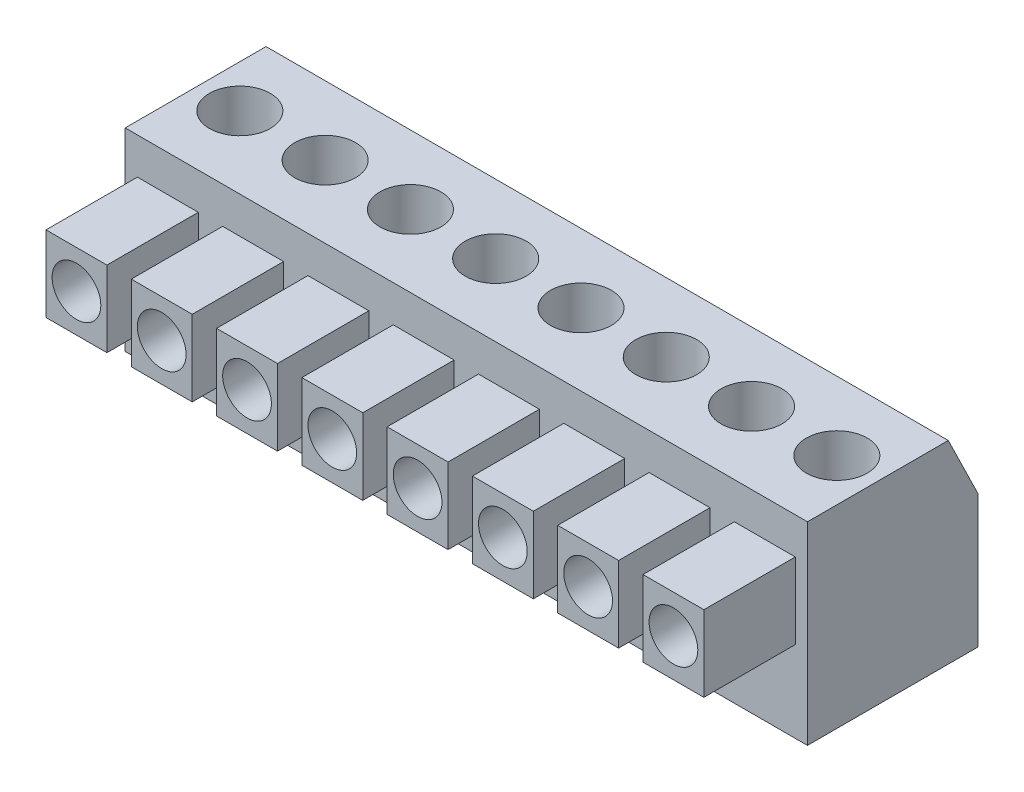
from build123d import *

# Parameters (mm, degrees)
SKIZZE1_W                       = 1.399920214
SKIZZE1_H                       = 1.589827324
AUFSATZ_LINEAR_AUSTRAGEN1_DEPTH = 0.7
SKIZZE2_W                       = 0.5
SKIZZE2_H                       = 0.694913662
SCHNITT_LINEAR_AUSTRAGEN1_DEPTH = 1
SKIZZE3_R                       = 0.25
SCHNITT_LINEAR_AUSTRAGEN2_DEPTH = 0.794913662
SKIZZE4_W                       = 0.5
SKIZZE4_H                       = 0.623099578
AUFSATZ_LINEAR_AUSTRAGEN2_DEPTH = 0.75
SCHNITT_LINEAR_AUSTRAGEN3_REACH = 4.397
SKIZZE5_R                       = 0.2
LINEARES_MUSTER2_COUNT          = 8
LINEARES_MUSTER2_PITCH          = 0.7
FASE2_SIZE                      = 0.5
FASE2_SIZE2                     = 0.243866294
SKALIEREN1_SCALE                = 5.556


with BuildPart() as part:
    # Skizze1 → Aufsatz-Linear austragen1 (new body)
    with BuildSketch(Plane(origin=(0, 0, 0), x_dir=(0, 0, -1), z_dir=(1, 0, 0))):
        Rectangle(SKIZZE1_W, SKIZZE1_H)
    aufsatz_linear_austragen1 = extrude(amount=AUFSATZ_LINEAR_AUSTRAGEN1_DEPTH)

    # Skizze2 → Schnitt-Linear austragen1 (cut)
    with BuildSketch(Plane(origin=(0, 0, -0.699960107), x_dir=(-1, 0, 0), z_dir=(0, 0, -1))):
        with Locations((-0.35, -0.347456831)):
            Rectangle(SKIZZE2_W, SKIZZE2_H)
    schnitt_linear_austragen1 = extrude(amount=-SCHNITT_LINEAR_AUSTRAGEN1_DEPTH, mode=Mode.SUBTRACT)

    # Skizze3 → Schnitt-Linear austragen2 (cut)
    with BuildSketch(Plane(origin=(0, 0.794913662, 0), x_dir=(1, 0, 0), z_dir=(0, 1, 0))):
        with Locations(Location((0.35, -0.108836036, 0), (0, 0, 270))):
            Circle(SKIZZE3_R)
    schnitt_linear_austragen2 = extrude(amount=-SCHNITT_LINEAR_AUSTRAGEN2_DEPTH, mode=Mode.SUBTRACT)

    # Skizze4 → Aufsatz-Linear austragen2 (add)
    with BuildSketch(Plane.XY.offset(0.699960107)):
        with Locations((0.35, 0.183363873)):
            Rectangle(SKIZZE4_W, SKIZZE4_H)
    aufsatz_linear_austragen2 = extrude(amount=AUFSATZ_LINEAR_AUSTRAGEN2_DEPTH)

    # Schnitt-Linear austragen3: up to this face of the body (flat: up to its plane)
    schnitt_linear_austragen3_end = Plane(part.part.faces().sort_by_distance((0.35, -0.347456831, 0.300039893))[0])
    # Skizze5 → Schnitt-Linear austragen3 (cut, up to the picked face)
    with BuildSketch(Plane.XY.offset(1.449960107), mode=Mode.PRIVATE) as schnitt_linear_austragen3_sk1:
        with Locations((0.35, 0.183363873)):
            Circle(SKIZZE5_R)
    schnitt_linear_austragen3_tool1 = split(extrude(schnitt_linear_austragen3_sk1.sketch, amount=-SCHNITT_LINEAR_AUSTRAGEN3_REACH, mode=Mode.PRIVATE), bisect_by=schnitt_linear_austragen3_end, keep=Keep.BOTH, mode=Mode.PRIVATE)
    schnitt_linear_austragen3 = schnitt_linear_austragen3_tool1.solids().sort_by(Axis((0.35, 0.183364, 1.44996), (0, 0, -1)))[0]
    add(schnitt_linear_austragen3, mode=Mode.SUBTRACT)

    # Lineares Muster2: Aufsatz-Linear austragen1, Schnitt-Linear austragen1, Schnitt-Linear austragen2, Aufsatz-Linear austragen2, Schnitt-Linear austragen3 ×8
    with Locations(*[(-i * LINEARES_MUSTER2_PITCH, 0, 0) for i in range(1, LINEARES_MUSTER2_COUNT)]):
        add(aufsatz_linear_austragen1)
        add(schnitt_linear_austragen1, mode=Mode.SUBTRACT)
        add(schnitt_linear_austragen2, mode=Mode.SUBTRACT)
        add(aufsatz_linear_austragen2)
        add(schnitt_linear_austragen3, mode=Mode.SUBTRACT)

    # Fase2
    fase2_edges = [part.edges().sort_by_distance(p)[0] for p in [
        (-2.1, 0.794913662, -0.699960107),
    ]]
    fase2_side = [part.faces().sort_by_distance(p)[0] for p in [
        (-2.1, 0.157725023, -0.699960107),
    ]]
    chamfer(fase2_edges, length=FASE2_SIZE, length2=FASE2_SIZE2, reference=fase2_side[0])


with BuildPart() as part_1:
    # Skalieren1: scaled about (-2.099999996, 0.044419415, 0.185562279)
    add(part.part.scale(SKALIEREN1_SCALE).moved(Location((9.567599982, -0.202374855, -0.845421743))))


solid = part_1.part
